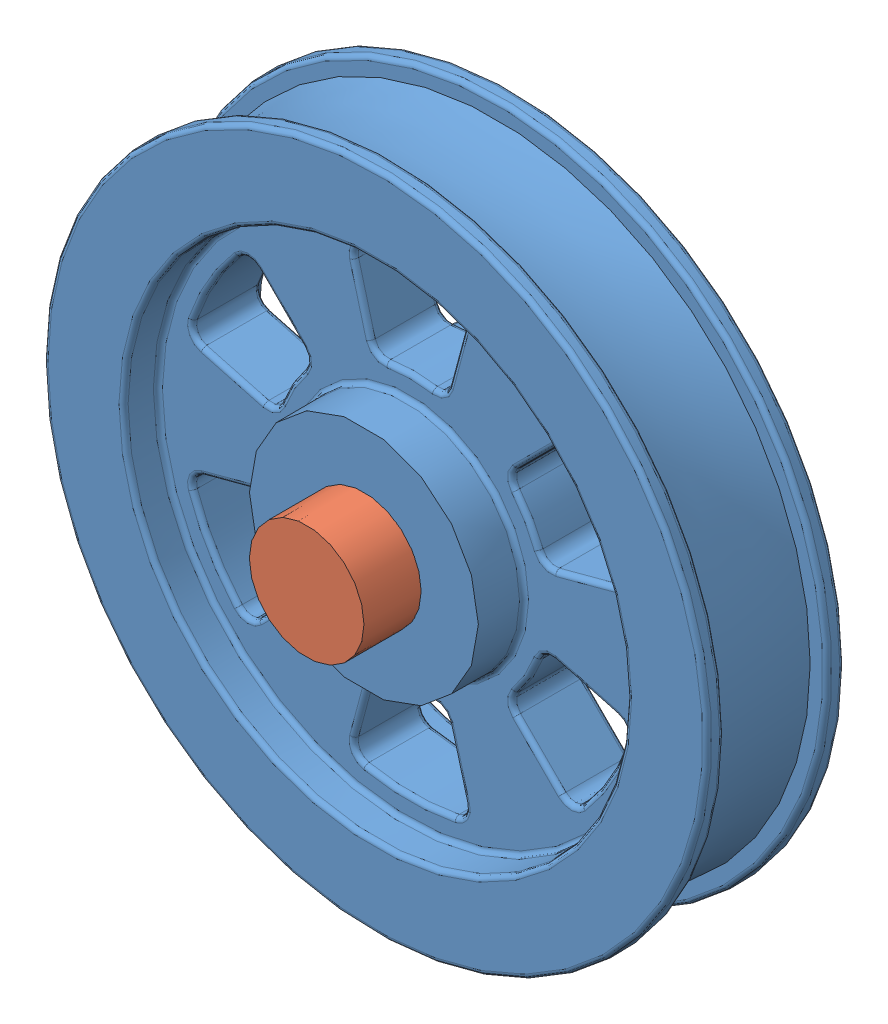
SolidWorks assembly Wheel Shaft Assembly.SLDASM, configuration Default (file format 3100). Lengths in mm.
Overall size (368.3 368.3 152.4).
2 component instances, 2 part files, 2 mates.
Components (placement in the parent):
- wheel-1: wheel.SLDPRT [Default] at origin size (368.3 368.3 88.9)
- Shaft-2: Shaft.SLDPRT [Default] at origin size (63.6 63.6 152.4)
Mates (geometry in assembly coordinates):
- Concentric1: concentric anti-aligned: cylinder of wheel-1; cylinder of Shaft-2
- Coincident1: coincident = 201.8554 mm: point of ?
